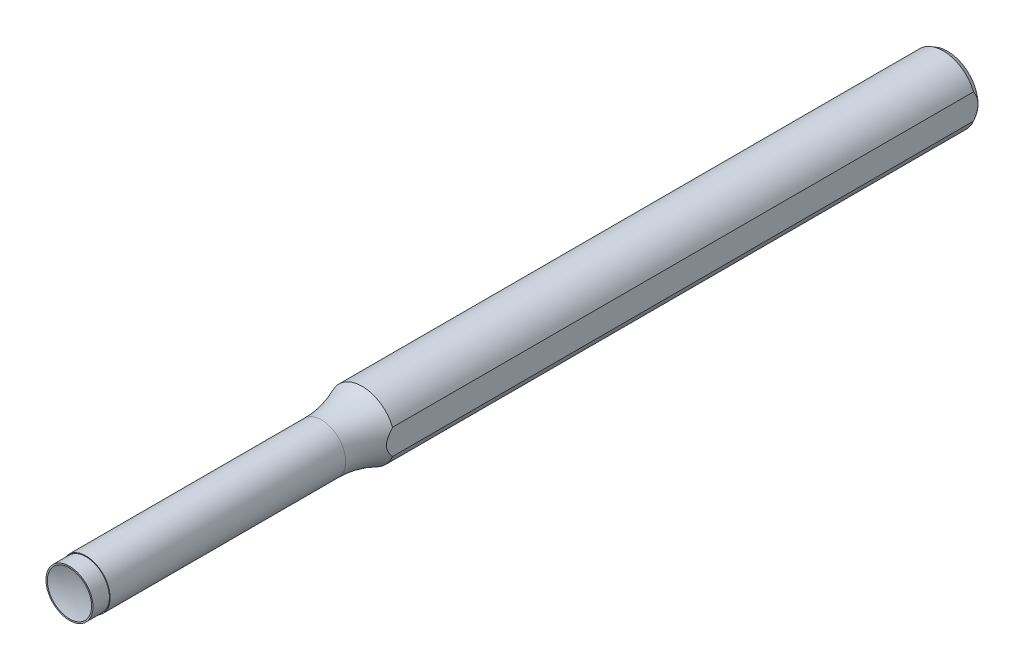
ISO-10303-21;
HEADER;
FILE_DESCRIPTION(('STEP AP214'),'2;1');
FILE_NAME('part.step','',(''),(''),'','','');
FILE_SCHEMA(('AUTOMOTIVE_DESIGN { 1 0 10303 214 1 1 1 1 }'));
ENDSEC;
DATA;
#1=APPLICATION_CONTEXT('core data for automotive mechanical design processes');
#2=APPLICATION_PROTOCOL_DEFINITION('international standard','automotive_design',2000,#1);
#3=PRODUCT_CONTEXT('',#1,'mechanical');
#4=PRODUCT('Part','Part','',(#3));
#5=PRODUCT_RELATED_PRODUCT_CATEGORY('part','',(#4));
#6=PRODUCT_DEFINITION_FORMATION('','',#4);
#7=PRODUCT_DEFINITION_CONTEXT('part definition',#1,'design');
#8=PRODUCT_DEFINITION('design','',#6,#7);
#9=PRODUCT_DEFINITION_SHAPE('','',#8);
#10=(LENGTH_UNIT() NAMED_UNIT(*) SI_UNIT(.MILLI.,.METRE.));
#11=(NAMED_UNIT(*) PLANE_ANGLE_UNIT() SI_UNIT($,.RADIAN.));
#12=(NAMED_UNIT(*) SI_UNIT($,.STERADIAN.) SOLID_ANGLE_UNIT());
#13=UNCERTAINTY_MEASURE_WITH_UNIT(LENGTH_MEASURE(1.E-05),#10,'distance_accuracy_value','');
#14=(GEOMETRIC_REPRESENTATION_CONTEXT(3) GLOBAL_UNCERTAINTY_ASSIGNED_CONTEXT((#13)) GLOBAL_UNIT_ASSIGNED_CONTEXT((#10,
#11,#12)) REPRESENTATION_CONTEXT('',''));
#15=CARTESIAN_POINT('',(0.,0.,0.));
#16=DIRECTION('',(0.,0.,1.));
#17=DIRECTION('',(1.,0.,0.));
#18=AXIS2_PLACEMENT_3D('',#15,#16,#17);
#19=CARTESIAN_POINT('',(0.,0.,-42.3333333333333));
#20=DIRECTION('',(0.,0.,1.));
#21=DIRECTION('',(1.,0.,0.));
#22=AXIS2_PLACEMENT_3D('',#19,#20,#21);
#23=CYLINDRICAL_SURFACE('',#22,3.5);
#24=CARTESIAN_POINT('',(0.,0.,-36.4540370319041));
#25=DIRECTION('',(0.,0.,1.));
#26=DIRECTION('',(0.,-1.,0.));
#27=AXIS2_PLACEMENT_3D('',#24,#25,#26);
#28=CIRCLE('',#27,3.5);
#29=CARTESIAN_POINT('',(0.,-3.5,-36.4540370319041));
#30=VERTEX_POINT('',#29);
#31=EDGE_CURVE('E79',#30,#30,#28,.F.);
#32=ORIENTED_EDGE('',*,*,#31,.F.);
#33=EDGE_LOOP('',(#32));
#34=FACE_BOUND('',#33,.T.);
#35=CARTESIAN_POINT('',(0.,0.,-2.3825));
#36=DIRECTION('',(0.,0.,1.));
#37=DIRECTION('',(1.,0.,0.));
#38=AXIS2_PLACEMENT_3D('',#35,#36,#37);
#39=CIRCLE('',#38,3.5);
#40=CARTESIAN_POINT('',(3.5,0.,-2.3825));
#41=VERTEX_POINT('',#40);
#42=EDGE_CURVE('E90',#41,#41,#39,.F.);
#43=ORIENTED_EDGE('',*,*,#42,.T.);
#44=EDGE_LOOP('',(#43));
#45=FACE_BOUND('',#44,.T.);
#46=ADVANCED_FACE('F42',(#34,#45),#23,.T.);
#47=CARTESIAN_POINT('',(0.,0.,-2.3825));
#48=DIRECTION('',(0.,0.,1.));
#49=DIRECTION('',(1.,0.,0.));
#50=AXIS2_PLACEMENT_3D('',#47,#48,#49);
#51=PLANE('',#50);
#52=ORIENTED_EDGE('',*,*,#42,.F.);
#53=EDGE_LOOP('',(#52));
#54=FACE_BOUND('',#53,.T.);
#55=CARTESIAN_POINT('',(0.,0.,-2.3825));
#56=DIRECTION('',(0.,0.,1.));
#57=DIRECTION('',(1.,0.,0.));
#58=AXIS2_PLACEMENT_3D('',#55,#56,#57);
#59=CIRCLE('',#58,3.4);
#60=CARTESIAN_POINT('',(3.4,0.,-2.3825));
#61=VERTEX_POINT('',#60);
#62=EDGE_CURVE('E97',#61,#61,#59,.T.);
#63=ORIENTED_EDGE('',*,*,#62,.F.);
#64=EDGE_LOOP('',(#63));
#65=FACE_BOUND('',#64,.T.);
#66=ADVANCED_FACE('F110',(#54,#65),#51,.T.);
#67=CARTESIAN_POINT('',(0.,0.,-2.3825));
#68=DIRECTION('',(0.,0.,1.));
#69=DIRECTION('',(1.,0.,0.));
#70=AXIS2_PLACEMENT_3D('',#67,#68,#69);
#71=CYLINDRICAL_SURFACE('',#70,3.4);
#72=ORIENTED_EDGE('',*,*,#62,.T.);
#73=EDGE_LOOP('',(#72));
#74=FACE_BOUND('',#73,.T.);
#75=CARTESIAN_POINT('',(0.,0.,0.));
#76=DIRECTION('',(0.,0.,1.));
#77=DIRECTION('',(1.,0.,0.));
#78=AXIS2_PLACEMENT_3D('',#75,#76,#77);
#79=CIRCLE('',#78,3.4);
#80=CARTESIAN_POINT('',(3.4,0.,0.));
#81=VERTEX_POINT('',#80);
#82=EDGE_CURVE('E122',#81,#81,#79,.T.);
#83=ORIENTED_EDGE('',*,*,#82,.F.);
#84=EDGE_LOOP('',(#83));
#85=FACE_BOUND('',#84,.T.);
#86=ADVANCED_FACE('F116',(#74,#85),#71,.T.);
#87=CARTESIAN_POINT('',(0.,0.,0.));
#88=DIRECTION('',(0.,0.,1.));
#89=DIRECTION('',(1.,0.,0.));
#90=AXIS2_PLACEMENT_3D('',#87,#88,#89);
#91=PLANE('',#90);
#92=CARTESIAN_POINT('',(0.,0.,0.));
#93=DIRECTION('',(0.,0.,1.));
#94=DIRECTION('',(0.,-1.,0.));
#95=AXIS2_PLACEMENT_3D('',#92,#93,#94);
#96=CIRCLE('',#95,3.2);
#97=CARTESIAN_POINT('',(0.,-3.2,0.));
#98=VERTEX_POINT('',#97);
#99=EDGE_CURVE('E126',#98,#98,#96,.T.);
#100=ORIENTED_EDGE('',*,*,#99,.F.);
#101=EDGE_LOOP('',(#100));
#102=FACE_BOUND('',#101,.T.);
#103=ORIENTED_EDGE('',*,*,#82,.T.);
#104=EDGE_LOOP('',(#103));
#105=FACE_BOUND('',#104,.T.);
#106=ADVANCED_FACE('F157',(#102,#105),#91,.T.);
#107=CARTESIAN_POINT('',(0.,0.,8.97668647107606));
#108=DIRECTION('',(0.,0.,1.));
#109=DIRECTION('',(0.,-1.,0.));
#110=AXIS2_PLACEMENT_3D('',#107,#108,#109);
#111=SPHERICAL_SURFACE('',#110,9.53);
#112=ORIENTED_EDGE('',*,*,#99,.T.);
#113=EDGE_LOOP('',(#112));
#114=FACE_BOUND('',#113,.T.);
#115=ADVANCED_FACE('F160',(#114),#111,.F.);
#116=CARTESIAN_POINT('',(0.,0.,-36.4540370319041));
#117=DIRECTION('',(0.,0.,-1.));
#118=DIRECTION('',(0.,1.,0.));
#119=AXIS2_PLACEMENT_3D('',#116,#117,#118);
#120=TOROIDAL_SURFACE('',#119,17.795,14.295);
#121=CARTESIAN_POINT('',(4.39819012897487,8.7625203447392,-48.3071798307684));
#122=CARTESIAN_POINT('',(4.39819012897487,8.55798140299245,-48.1839581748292));
#123=CARTESIAN_POINT('',(4.39819012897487,8.355801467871,-48.0568511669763));
#124=CARTESIAN_POINT('',(4.39819012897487,7.95623473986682,-47.7953866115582));
#125=CARTESIAN_POINT('',(4.39819012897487,7.75884708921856,-47.6610303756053));
#126=CARTESIAN_POINT('',(4.39819012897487,7.36921657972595,-47.3857901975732));
#127=CARTESIAN_POINT('',(4.39819012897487,7.17696511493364,-47.244918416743));
#128=CARTESIAN_POINT('',(4.39819012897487,6.79717391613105,-46.9569524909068));
#129=CARTESIAN_POINT('',(4.39819012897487,6.6096343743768,-46.8098580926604));
#130=CARTESIAN_POINT('',(4.39819012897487,6.24467460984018,-46.5145107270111));
#131=CARTESIAN_POINT('',(4.39819012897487,6.06711950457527,-46.3664241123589));
#132=CARTESIAN_POINT('',(4.39819012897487,5.71607860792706,-46.0655016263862));
#133=CARTESIAN_POINT('',(4.39819012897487,5.54259293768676,-45.9126656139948));
#134=CARTESIAN_POINT('',(4.39819012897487,5.19930517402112,-45.6028384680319));
#135=CARTESIAN_POINT('',(4.39819012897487,5.02950397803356,-45.4458463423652));
#136=CARTESIAN_POINT('',(4.39819012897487,4.69312593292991,-45.1284538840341));
#137=CARTESIAN_POINT('',(4.39819012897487,4.52654908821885,-44.9680535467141));
#138=CARTESIAN_POINT('',(4.39819012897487,4.21818390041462,-44.6664751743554));
#139=CARTESIAN_POINT('',(4.39819012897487,4.07607959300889,-44.5256190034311));
#140=CARTESIAN_POINT('',(4.39819012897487,3.79310894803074,-44.2426511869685));
#141=CARTESIAN_POINT('',(4.39819012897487,3.65224270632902,-44.1005394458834));
#142=CARTESIAN_POINT('',(4.39819012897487,3.36883918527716,-43.8138369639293));
#143=CARTESIAN_POINT('',(4.39819012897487,3.22630774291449,-43.6692404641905));
#144=CARTESIAN_POINT('',(4.39819012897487,2.94050254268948,-43.3809821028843));
#145=CARTESIAN_POINT('',(4.39819012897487,2.79722936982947,-43.2373196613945));
#146=CARTESIAN_POINT('',(4.39819012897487,2.50610214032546,-42.950683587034));
#147=CARTESIAN_POINT('',(4.39819012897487,2.3582123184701,-42.8077456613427));
#148=CARTESIAN_POINT('',(4.39819012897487,2.1320035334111,-42.5975316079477));
#149=CARTESIAN_POINT('',(4.39819012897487,2.05574430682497,-42.5280497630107));
#150=CARTESIAN_POINT('',(4.39819012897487,1.90134238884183,-42.3912186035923));
#151=CARTESIAN_POINT('',(4.39819012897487,1.82319994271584,-42.3238690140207));
#152=CARTESIAN_POINT('',(4.39819012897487,1.66586774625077,-42.1933476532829));
#153=CARTESIAN_POINT('',(4.39819012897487,1.58672285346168,-42.1301221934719));
#154=CARTESIAN_POINT('',(4.39819012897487,1.42528649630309,-42.0076750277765));
#155=CARTESIAN_POINT('',(4.39819012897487,1.34299323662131,-41.9484556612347));
#156=CARTESIAN_POINT('',(4.39819012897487,1.1750125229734,-41.8360893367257));
#157=CARTESIAN_POINT('',(4.39819012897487,1.08934775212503,-41.7829088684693));
#158=CARTESIAN_POINT('',(4.39819012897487,0.913515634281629,-41.6847014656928));
#159=CARTESIAN_POINT('',(4.39819012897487,0.823355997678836,-41.639661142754));
#160=CARTESIAN_POINT('',(4.39819012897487,0.682798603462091,-41.5799660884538));
#161=CARTESIAN_POINT('',(4.39819012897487,0.634179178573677,-41.5611287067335));
#162=CARTESIAN_POINT('',(4.39819012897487,0.535682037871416,-41.5270449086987));
#163=CARTESIAN_POINT('',(4.39819012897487,0.485803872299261,-41.5117997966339));
#164=CARTESIAN_POINT('',(4.39819012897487,0.334704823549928,-41.4723668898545));
#165=CARTESIAN_POINT('',(4.39819012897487,0.231738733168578,-41.454356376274));
#166=CARTESIAN_POINT('',(4.39819012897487,0.0234191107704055,-41.4381203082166));
#167=CARTESIAN_POINT('',(4.39819012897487,-0.0819465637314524,-41.440044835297));
#168=CARTESIAN_POINT('',(4.39819012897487,-0.290461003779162,-41.4636397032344));
#169=CARTESIAN_POINT('',(4.39819012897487,-0.393606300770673,-41.4853389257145));
#170=CARTESIAN_POINT('',(4.39819012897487,-0.629220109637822,-41.5548111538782));
#171=CARTESIAN_POINT('',(4.39819012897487,-0.759757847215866,-41.6089344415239));
#172=CARTESIAN_POINT('',(4.39819012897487,-0.948469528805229,-41.7039049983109));
#173=CARTESIAN_POINT('',(4.39819012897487,-1.01034874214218,-41.7379705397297));
#174=CARTESIAN_POINT('',(4.39819012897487,-1.13195140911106,-41.8097442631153));
#175=CARTESIAN_POINT('',(4.39819012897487,-1.19167561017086,-41.8474511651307));
#176=CARTESIAN_POINT('',(4.39819012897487,-1.36369991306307,-41.9619319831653));
#177=CARTESIAN_POINT('',(4.39819012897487,-1.47343382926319,-42.0425282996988));
#178=CARTESIAN_POINT('',(4.39819012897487,-1.68782092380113,-42.2102659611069));
#179=CARTESIAN_POINT('',(4.39819012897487,-1.79246915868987,-42.2974134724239));
#180=CARTESIAN_POINT('',(4.39819012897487,-1.99842521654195,-42.4761009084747));
#181=CARTESIAN_POINT('',(4.39819012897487,-2.099722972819,-42.567652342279));
#182=CARTESIAN_POINT('',(4.39819012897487,-2.29986033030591,-42.7534089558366));
#183=CARTESIAN_POINT('',(4.39819012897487,-2.39869957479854,-42.8476145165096));
#184=CARTESIAN_POINT('',(4.39819012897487,-2.59557276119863,-43.0384090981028));
#185=CARTESIAN_POINT('',(4.39819012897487,-2.69359404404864,-43.1350111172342));
#186=CARTESIAN_POINT('',(4.39819012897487,-2.88871469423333,-43.3291531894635));
#187=CARTESIAN_POINT('',(4.39819012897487,-2.98581398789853,-43.426693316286));
#188=CARTESIAN_POINT('',(4.39819012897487,-3.27622073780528,-43.7195602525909));
#189=CARTESIAN_POINT('',(4.39819012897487,-3.46895689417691,-43.9154511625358));
#190=CARTESIAN_POINT('',(4.39819012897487,-3.85649524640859,-44.3064617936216));
#191=CARTESIAN_POINT('',(4.39819012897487,-4.0513021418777,-44.501576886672));
#192=CARTESIAN_POINT('',(4.39819012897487,-4.44422198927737,-44.8884633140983));
#193=CARTESIAN_POINT('',(4.39819012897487,-4.64233489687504,-45.0802346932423));
#194=CARTESIAN_POINT('',(4.39819012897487,-5.04311377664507,-45.4589569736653));
#195=CARTESIAN_POINT('',(4.39819012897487,-5.2457795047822,-45.6459081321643));
#196=CARTESIAN_POINT('',(4.39819012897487,-5.65649480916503,-46.0137951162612));
#197=CARTESIAN_POINT('',(4.39819012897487,-5.86454408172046,-46.1947312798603));
#198=CARTESIAN_POINT('',(4.39819012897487,-6.28665876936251,-46.5496348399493));
#199=CARTESIAN_POINT('',(4.39819012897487,-6.50072652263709,-46.7235994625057));
#200=CARTESIAN_POINT('',(4.39819012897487,-6.93509652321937,-47.0635463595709));
#201=CARTESIAN_POINT('',(4.39819012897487,-7.1553983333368,-47.2295291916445));
#202=CARTESIAN_POINT('',(4.39819012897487,-7.6030595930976,-47.5531548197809));
#203=CARTESIAN_POINT('',(4.39819012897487,-7.83043809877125,-47.7107713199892));
#204=CARTESIAN_POINT('',(4.39819012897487,-8.29165674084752,-48.0163943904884));
#205=CARTESIAN_POINT('',(4.39819012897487,-8.52549878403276,-48.1643980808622));
#206=CARTESIAN_POINT('',(4.39819012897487,-8.7625203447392,-48.3071798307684));
#207=B_SPLINE_CURVE_WITH_KNOTS('',3,(#121,#122,#123,#124,#125,#126,#127,#128,#129,#130,#131,
#132,#133,#134,#135,#136,#137,#138,#139,#140,#141,#142,#143,#144,#145,#146,#147,#148,#149,#150,
#151,#152,#153,#154,#155,#156,#157,#158,#159,#160,#161,#162,#163,#164,#165,#166,#167,#168,#169,
#170,#171,#172,#173,#174,#175,#176,#177,#178,#179,#180,#181,#182,#183,#184,#185,#186,#187,#188,
#189,#190,#191,#192,#193,#194,#195,#196,#197,#198,#199,#200,#201,#202,#203,#204,#205,#206),
.UNSPECIFIED.,.F.,.F.,(4,2,2,2,2,2,2,2,2,2,2,2,2,2,2,2,2,2,2,2,2,2,2,2,2,2,2,2,2,2,2,2,2,2,2,2,
2,2,2,2,2,2,4),(0.,0.71629829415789,1.43246741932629,2.14734988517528,2.86226147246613,
3.55578229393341,4.24932373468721,4.94303224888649,5.63674171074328,6.23698566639,
6.83727570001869,7.4463806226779,8.05506205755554,8.67199073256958,8.98146084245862,
9.29089086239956,9.5946961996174,9.89867743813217,10.2008796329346,10.5025801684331,
10.658878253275,10.8152329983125,11.127030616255,11.4411773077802,11.7557835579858,
12.1771789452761,12.3890267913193,12.6008004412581,13.0088201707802,13.417228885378,
13.8267700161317,14.2363702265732,14.649228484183,15.0621194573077,15.8865493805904,
16.7136798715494,17.5407992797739,18.3678744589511,19.1949030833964,20.0222575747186,
20.849554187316,21.6793133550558,22.5093199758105),.UNSPECIFIED.);
#208=CARTESIAN_POINT('',(4.39819012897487,1.83334355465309,-42.3333333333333));
#209=VERTEX_POINT('',#208);
#210=CARTESIAN_POINT('',(4.39819012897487,-1.83334355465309,-42.3333333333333));
#211=VERTEX_POINT('',#210);
#212=EDGE_CURVE('E58',#209,#211,#207,.T.);
#213=ORIENTED_EDGE('',*,*,#212,.F.);
#214=CARTESIAN_POINT('',(0.,0.,-42.3333333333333));
#215=DIRECTION('',(0.,0.,-1.));
#216=DIRECTION('',(0.,1.,0.));
#217=AXIS2_PLACEMENT_3D('',#214,#215,#216);
#218=CIRCLE('',#217,4.765);
#219=EDGE_CURVE('E131',#211,#209,#218,.T.);
#220=ORIENTED_EDGE('',*,*,#219,.F.);
#221=EDGE_LOOP('',(#213,#220));
#222=FACE_BOUND('',#221,.T.);
#223=ORIENTED_EDGE('',*,*,#31,.T.);
#224=EDGE_LOOP('',(#223));
#225=FACE_BOUND('',#224,.T.);
#226=ADVANCED_FACE('F106',(#222,#225),#120,.F.);
#227=CARTESIAN_POINT('',(0.,0.,-127.));
#228=DIRECTION('',(0.,0.,1.));
#229=DIRECTION('',(1.,0.,0.));
#230=AXIS2_PLACEMENT_3D('',#227,#228,#229);
#231=PLANE('',#230);
#232=CARTESIAN_POINT('',(0.,0.,-127.));
#233=DIRECTION('',(0.,0.,1.));
#234=DIRECTION('',(1.,0.,0.));
#235=AXIS2_PLACEMENT_3D('',#232,#233,#234);
#236=CIRCLE('',#235,4.39819012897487);
#237=CARTESIAN_POINT('',(4.39819012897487,0.,-127.));
#238=VERTEX_POINT('',#237);
#239=EDGE_CURVE('E85',#238,#238,#236,.F.);
#240=ORIENTED_EDGE('',*,*,#239,.T.);
#241=EDGE_LOOP('',(#240));
#242=FACE_BOUND('',#241,.T.);
#243=ADVANCED_FACE('F155',(#242),#231,.F.);
#244=CARTESIAN_POINT('',(0.,0.,-126.364666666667));
#245=DIRECTION('',(0.,0.,1.));
#246=DIRECTION('',(1.,0.,0.));
#247=AXIS2_PLACEMENT_3D('',#244,#245,#246);
#248=CONICAL_SURFACE('',#247,4.765,0.523598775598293);
#249=CARTESIAN_POINT('',(4.39819012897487,-5.33423797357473,-122.64314394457));
#250=CARTESIAN_POINT('',(4.39819012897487,-5.23964449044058,-122.769540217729));
#251=CARTESIAN_POINT('',(4.39819012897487,-5.14441079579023,-122.895461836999));
#252=CARTESIAN_POINT('',(4.39819012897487,-4.95244135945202,-123.14617446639));
#253=CARTESIAN_POINT('',(4.39819012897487,-4.85570546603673,-123.270965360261));
#254=CARTESIAN_POINT('',(4.39819012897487,-4.66025992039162,-123.519551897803));
#255=CARTESIAN_POINT('',(4.39819012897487,-4.56154555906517,-123.643343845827));
#256=CARTESIAN_POINT('',(4.39819012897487,-4.36213663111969,-123.889318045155));
#257=CARTESIAN_POINT('',(4.39819012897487,-4.26144213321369,-124.01150035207));
#258=CARTESIAN_POINT('',(4.39819012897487,-4.05667136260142,-124.255205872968));
#259=CARTESIAN_POINT('',(4.39819012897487,-3.95257064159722,-124.376708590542));
#260=CARTESIAN_POINT('',(4.39819012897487,-3.74160194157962,-124.617285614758));
#261=CARTESIAN_POINT('',(4.39819012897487,-3.63473408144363,-124.73636002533));
#262=CARTESIAN_POINT('',(4.39819012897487,-3.41782749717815,-124.971366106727));
#263=CARTESIAN_POINT('',(4.39819012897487,-3.30779217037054,-125.087300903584));
#264=CARTESIAN_POINT('',(4.39819012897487,-3.08382779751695,-125.315332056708));
#265=CARTESIAN_POINT('',(4.39819012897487,-2.96989944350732,-125.427429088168));
#266=CARTESIAN_POINT('',(4.39819012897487,-2.77186488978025,-125.614120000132));
#267=CARTESIAN_POINT('',(4.39819012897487,-2.68894403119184,-125.68996971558));
#268=CARTESIAN_POINT('',(4.39819012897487,-2.52044667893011,-125.838685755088));
#269=CARTESIAN_POINT('',(4.39819012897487,-2.43486999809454,-125.911551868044));
#270=CARTESIAN_POINT('',(4.39819012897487,-2.26054924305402,-126.053736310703));
#271=CARTESIAN_POINT('',(4.39819012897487,-2.17179979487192,-126.123048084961));
#272=CARTESIAN_POINT('',(4.39819012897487,-1.99088174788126,-126.257087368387));
#273=CARTESIAN_POINT('',(4.39819012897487,-1.89871312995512,-126.321814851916));
#274=CARTESIAN_POINT('',(4.39819012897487,-1.7090542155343,-126.446513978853));
#275=CARTESIAN_POINT('',(4.39819012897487,-1.61150226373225,-126.506392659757));
#276=CARTESIAN_POINT('',(4.39819012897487,-1.41210644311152,-126.618657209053));
#277=CARTESIAN_POINT('',(4.39819012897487,-1.31026180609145,-126.671041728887));
#278=CARTESIAN_POINT('',(4.39819012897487,-1.10269294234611,-126.766129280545));
#279=CARTESIAN_POINT('',(4.39819012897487,-0.996989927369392,-126.808878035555));
#280=CARTESIAN_POINT('',(4.39819012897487,-0.781614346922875,-126.882793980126));
#281=CARTESIAN_POINT('',(4.39819012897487,-0.67194529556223,-126.913971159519));
#282=CARTESIAN_POINT('',(4.39819012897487,-0.488020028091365,-126.954270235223));
#283=CARTESIAN_POINT('',(4.39819012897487,-0.414608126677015,-126.967290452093));
#284=CARTESIAN_POINT('',(4.39819012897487,-0.266950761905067,-126.987044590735));
#285=CARTESIAN_POINT('',(4.39819012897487,-0.192705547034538,-126.993780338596));
#286=CARTESIAN_POINT('',(4.39819012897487,-0.0439156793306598,-127.000708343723));
#287=CARTESIAN_POINT('',(4.39819012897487,0.0306289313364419,-127.000901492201));
#288=CARTESIAN_POINT('',(4.39819012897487,0.179435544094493,-126.994754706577));
#289=CARTESIAN_POINT('',(4.39819012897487,0.253697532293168,-126.988414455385));
#290=CARTESIAN_POINT('',(4.39819012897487,0.474629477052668,-126.959962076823));
#291=CARTESIAN_POINT('',(4.39819012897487,0.620159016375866,-126.928448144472));
#292=CARTESIAN_POINT('',(4.39819012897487,0.904823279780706,-126.844288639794));
#293=CARTESIAN_POINT('',(4.39819012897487,1.04395187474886,-126.791623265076));
#294=CARTESIAN_POINT('',(4.39819012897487,1.30222792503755,-126.675763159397));
#295=CARTESIAN_POINT('',(4.39819012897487,1.42203206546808,-126.61399704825));
#296=CARTESIAN_POINT('',(4.39819012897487,1.65585339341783,-126.480248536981));
#297=CARTESIAN_POINT('',(4.39819012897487,1.76986529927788,-126.40825703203));
#298=CARTESIAN_POINT('',(4.39819012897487,1.99362460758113,-126.255843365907));
#299=CARTESIAN_POINT('',(4.39819012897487,2.10332163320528,-126.175348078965));
#300=CARTESIAN_POINT('',(4.39819012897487,2.31795882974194,-126.008389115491));
#301=CARTESIAN_POINT('',(4.39819012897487,2.42290098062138,-125.921927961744));
#302=CARTESIAN_POINT('',(4.39819012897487,2.66383353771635,-125.714113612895));
#303=CARTESIAN_POINT('',(4.39819012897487,2.79822037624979,-125.590909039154));
#304=CARTESIAN_POINT('',(4.39819012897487,3.0611757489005,-125.338408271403));
#305=CARTESIAN_POINT('',(4.39819012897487,3.18974214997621,-125.209109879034));
#306=CARTESIAN_POINT('',(4.39819012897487,3.44236417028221,-124.945697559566));
#307=CARTESIAN_POINT('',(4.39819012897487,3.56641012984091,-124.811574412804));
#308=CARTESIAN_POINT('',(4.39819012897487,3.81058734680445,-124.539807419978));
#309=CARTESIAN_POINT('',(4.39819012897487,3.93071829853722,-124.402163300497));
#310=CARTESIAN_POINT('',(4.39819012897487,4.16130930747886,-124.131643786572));
#311=CARTESIAN_POINT('',(4.39819012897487,4.27194072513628,-123.998913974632));
#312=CARTESIAN_POINT('',(4.39819012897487,4.49075134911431,-123.731440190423));
#313=CARTESIAN_POINT('',(4.39819012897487,4.59893042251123,-123.59669610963));
#314=CARTESIAN_POINT('',(4.39819012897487,4.81265144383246,-123.326247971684));
#315=CARTESIAN_POINT('',(4.39819012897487,4.91820400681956,-123.190552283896));
#316=CARTESIAN_POINT('',(4.39819012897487,5.12750213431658,-122.917805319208));
#317=CARTESIAN_POINT('',(4.39819012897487,5.23124796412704,-122.780754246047));
#318=CARTESIAN_POINT('',(4.39819012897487,5.33423797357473,-122.64314394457));
#319=B_SPLINE_CURVE_WITH_KNOTS('',3,(#249,#250,#251,#252,#253,#254,#255,#256,#257,#258,#259,
#260,#261,#262,#263,#264,#265,#266,#267,#268,#269,#270,#271,#272,#273,#274,#275,#276,#277,#278,
#279,#280,#281,#282,#283,#284,#285,#286,#287,#288,#289,#290,#291,#292,#293,#294,#295,#296,#297,
#298,#299,#300,#301,#302,#303,#304,#305,#306,#307,#308,#309,#310,#311,#312,#313,#314,#315,#316,
#317,#318),.UNSPECIFIED.,.F.,.F.,(4,2,2,2,2,2,2,2,2,2,2,2,2,2,2,2,2,2,2,2,2,2,2,2,2,2,2,2,2,2,2,
2,2,2,4),(0.,0.473622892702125,0.947293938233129,1.42227179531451,1.89723319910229,
2.37719719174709,2.85714059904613,3.33658712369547,3.81594885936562,4.15302867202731,
4.49013229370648,4.82783680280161,5.16554320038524,5.50866767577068,5.85185381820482,
6.19337550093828,6.53460165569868,6.75803376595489,6.98140093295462,7.20473767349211,
7.42808525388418,7.87266697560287,8.31766589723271,8.72141386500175,9.12552361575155,
9.53344563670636,9.94119620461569,10.4878713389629,11.0347452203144,11.5827263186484,
12.1307500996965,12.6490872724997,13.1674524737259,13.6831809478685,14.1988330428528),.UNSPECIFIED.);
#320=CARTESIAN_POINT('',(4.39819012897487,-1.83334355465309,-126.364666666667));
#321=VERTEX_POINT('',#320);
#322=EDGE_CURVE('E73',#321,#238,#319,.T.);
#323=ORIENTED_EDGE('',*,*,#322,.F.);
#324=CARTESIAN_POINT('',(0.,0.,-126.364666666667));
#325=DIRECTION('',(0.,0.,1.));
#326=DIRECTION('',(1.,0.,0.));
#327=AXIS2_PLACEMENT_3D('',#324,#325,#326);
#328=CIRCLE('',#327,4.765);
#329=CARTESIAN_POINT('',(4.39819012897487,1.83334355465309,-126.364666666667));
#330=VERTEX_POINT('',#329);
#331=EDGE_CURVE('E83',#330,#321,#328,.T.);
#332=ORIENTED_EDGE('',*,*,#331,.F.);
#333=EDGE_CURVE('E64',#238,#330,#319,.T.);
#334=ORIENTED_EDGE('',*,*,#333,.F.);
#335=ORIENTED_EDGE('',*,*,#239,.F.);
#336=EDGE_LOOP('',(#323,#332,#334,#335));
#337=FACE_BOUND('',#336,.T.);
#338=ADVANCED_FACE('F44',(#337),#248,.T.);
#339=CARTESIAN_POINT('',(0.,0.,-127.));
#340=DIRECTION('',(0.,0.,1.));
#341=DIRECTION('',(1.,0.,0.));
#342=AXIS2_PLACEMENT_3D('',#339,#340,#341);
#343=CYLINDRICAL_SURFACE('',#342,4.765);
#344=DIRECTION('',(0.,0.,1.));
#345=VECTOR('',#344,1.);
#346=CARTESIAN_POINT('',(4.39819012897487,1.83334355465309,-127.));
#347=LINE('',#346,#345);
#348=EDGE_CURVE('E13',#330,#209,#347,.T.);
#349=ORIENTED_EDGE('',*,*,#348,.F.);
#350=ORIENTED_EDGE('',*,*,#331,.T.);
#351=DIRECTION('',(0.,0.,1.));
#352=VECTOR('',#351,1.);
#353=CARTESIAN_POINT('',(4.39819012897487,-1.83334355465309,-127.));
#354=LINE('',#353,#352);
#355=EDGE_CURVE('E52',#211,#321,#354,.F.);
#356=ORIENTED_EDGE('',*,*,#355,.F.);
#357=ORIENTED_EDGE('',*,*,#219,.T.);
#358=EDGE_LOOP('',(#349,#350,#356,#357));
#359=FACE_BOUND('',#358,.T.);
#360=ADVANCED_FACE('F88',(#359),#343,.T.);
#361=CARTESIAN_POINT('',(4.39819012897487,1.83334355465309,0.));
#362=DIRECTION('',(-1.,0.,0.));
#363=DIRECTION('',(0.,0.,1.));
#364=AXIS2_PLACEMENT_3D('',#361,#362,#363);
#365=PLANE('',#364);
#366=ORIENTED_EDGE('',*,*,#212,.T.);
#367=ORIENTED_EDGE('',*,*,#355,.T.);
#368=ORIENTED_EDGE('',*,*,#322,.T.);
#369=ORIENTED_EDGE('',*,*,#333,.T.);
#370=ORIENTED_EDGE('',*,*,#348,.T.);
#371=EDGE_LOOP('',(#366,#367,#368,#369,#370));
#372=FACE_BOUND('',#371,.T.);
#373=ADVANCED_FACE('F72',(#372),#365,.F.);
#374=CLOSED_SHELL('',(#46,#66,#86,#106,#115,#226,#243,#338,#360,#373));
#375=MANIFOLD_SOLID_BREP('B2',#374);
#376=ADVANCED_BREP_SHAPE_REPRESENTATION('',(#18,#375),#14);
#377=SHAPE_DEFINITION_REPRESENTATION(#9,#376);
ENDSEC;
END-ISO-10303-21;
